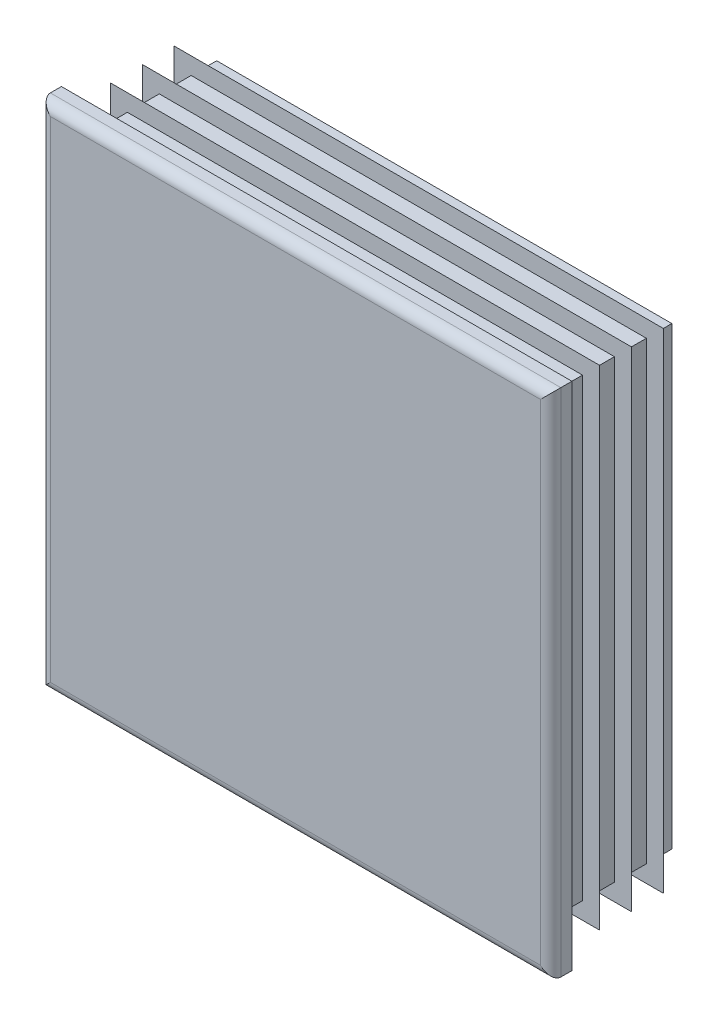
ISO-10303-21;
HEADER;
FILE_DESCRIPTION(('STEP AP214'),'2;1');
FILE_NAME('part.step','',(''),(''),'','','');
FILE_SCHEMA(('AUTOMOTIVE_DESIGN { 1 0 10303 214 1 1 1 1 }'));
ENDSEC;
DATA;
#1=APPLICATION_CONTEXT('core data for automotive mechanical design processes');
#2=APPLICATION_PROTOCOL_DEFINITION('international standard','automotive_design',2000,#1);
#3=PRODUCT_CONTEXT('',#1,'mechanical');
#4=PRODUCT('Part','Part','',(#3));
#5=PRODUCT_RELATED_PRODUCT_CATEGORY('part','',(#4));
#6=PRODUCT_DEFINITION_FORMATION('','',#4);
#7=PRODUCT_DEFINITION_CONTEXT('part definition',#1,'design');
#8=PRODUCT_DEFINITION('design','',#6,#7);
#9=PRODUCT_DEFINITION_SHAPE('','',#8);
#10=(LENGTH_UNIT() NAMED_UNIT(*) SI_UNIT(.MILLI.,.METRE.));
#11=(NAMED_UNIT(*) PLANE_ANGLE_UNIT() SI_UNIT($,.RADIAN.));
#12=(NAMED_UNIT(*) SI_UNIT($,.STERADIAN.) SOLID_ANGLE_UNIT());
#13=UNCERTAINTY_MEASURE_WITH_UNIT(LENGTH_MEASURE(1.E-05),#10,'distance_accuracy_value','');
#14=(GEOMETRIC_REPRESENTATION_CONTEXT(3) GLOBAL_UNCERTAINTY_ASSIGNED_CONTEXT((#13)) GLOBAL_UNIT_ASSIGNED_CONTEXT((#10,
#11,#12)) REPRESENTATION_CONTEXT('',''));
#15=CARTESIAN_POINT('',(0.,0.,0.));
#16=DIRECTION('',(0.,0.,1.));
#17=DIRECTION('',(1.,0.,0.));
#18=AXIS2_PLACEMENT_3D('',#15,#16,#17);
#19=CARTESIAN_POINT('',(57.6,-60.,5.));
#20=DIRECTION('',(0.,0.,-1.));
#21=DIRECTION('',(0.,1.,0.));
#22=AXIS2_PLACEMENT_3D('',#19,#20,#21);
#23=PLANE('',#22);
#24=DIRECTION('',(0.,1.,0.));
#25=VECTOR('',#24,1.);
#26=CARTESIAN_POINT('',(-57.6,-60.,5.));
#27=LINE('',#26,#25);
#28=CARTESIAN_POINT('',(-57.6,-57.6,5.));
#29=VERTEX_POINT('',#28);
#30=CARTESIAN_POINT('',(-57.6,57.6,5.));
#31=VERTEX_POINT('',#30);
#32=EDGE_CURVE('E262',#29,#31,#27,.T.);
#33=ORIENTED_EDGE('',*,*,#32,.F.);
#34=DIRECTION('',(-1.,0.,0.));
#35=VECTOR('',#34,1.);
#36=CARTESIAN_POINT('',(60.,-57.6,5.));
#37=LINE('',#36,#35);
#38=CARTESIAN_POINT('',(57.6,-57.6,5.));
#39=VERTEX_POINT('',#38);
#40=EDGE_CURVE('E432',#39,#29,#37,.T.);
#41=ORIENTED_EDGE('',*,*,#40,.F.);
#42=DIRECTION('',(0.,1.,0.));
#43=VECTOR('',#42,1.);
#44=CARTESIAN_POINT('',(57.6,-60.,5.));
#45=LINE('',#44,#43);
#46=CARTESIAN_POINT('',(57.6,57.6,5.));
#47=VERTEX_POINT('',#46);
#48=EDGE_CURVE('E257',#39,#47,#45,.T.);
#49=ORIENTED_EDGE('',*,*,#48,.T.);
#50=DIRECTION('',(-1.,0.,0.));
#51=VECTOR('',#50,1.);
#52=CARTESIAN_POINT('',(60.,57.6,5.));
#53=LINE('',#52,#51);
#54=EDGE_CURVE('E534',#47,#31,#53,.T.);
#55=ORIENTED_EDGE('',*,*,#54,.T.);
#56=EDGE_LOOP('',(#33,#41,#49,#55));
#57=FACE_BOUND('',#56,.T.);
#58=ADVANCED_FACE('F14',(#57),#23,.F.);
#59=CARTESIAN_POINT('',(-57.6,-60.,2.6));
#60=DIRECTION('',(0.,1.,0.));
#61=DIRECTION('',(-1.,0.,0.));
#62=AXIS2_PLACEMENT_3D('',#59,#60,#61);
#63=CYLINDRICAL_SURFACE('',#62,2.4);
#64=DIRECTION('',(0.,1.,0.));
#65=VECTOR('',#64,1.);
#66=CARTESIAN_POINT('',(-60.,-60.,2.6));
#67=LINE('',#66,#65);
#68=CARTESIAN_POINT('',(-60.,-60.,2.6));
#69=VERTEX_POINT('',#68);
#70=CARTESIAN_POINT('',(-60.,60.,2.6));
#71=VERTEX_POINT('',#70);
#72=EDGE_CURVE('E354',#69,#71,#67,.T.);
#73=ORIENTED_EDGE('',*,*,#72,.F.);
#74=CARTESIAN_POINT('',(-57.6,-57.6,2.6));
#75=DIRECTION('',(-0.707106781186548,0.707106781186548,0.));
#76=DIRECTION('',(0.707106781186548,0.707106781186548,0.));
#77=AXIS2_PLACEMENT_3D('',#74,#75,#76);
#78=ELLIPSE('',#77,3.39411254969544,2.4);
#79=EDGE_CURVE('E59',#69,#29,#78,.T.);
#80=ORIENTED_EDGE('',*,*,#79,.T.);
#81=ORIENTED_EDGE('',*,*,#32,.T.);
#82=CARTESIAN_POINT('',(-57.6,57.6,2.6));
#83=DIRECTION('',(0.707106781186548,0.707106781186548,0.));
#84=DIRECTION('',(-0.707106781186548,0.707106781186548,0.));
#85=AXIS2_PLACEMENT_3D('',#82,#83,#84);
#86=ELLIPSE('',#85,3.39411254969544,2.4);
#87=EDGE_CURVE('E258',#31,#71,#86,.F.);
#88=ORIENTED_EDGE('',*,*,#87,.T.);
#89=EDGE_LOOP('',(#73,#80,#81,#88));
#90=FACE_BOUND('',#89,.T.);
#91=ADVANCED_FACE('F16',(#90),#63,.T.);
#92=CARTESIAN_POINT('',(-60.,-60.,2.6));
#93=DIRECTION('',(1.,0.,0.));
#94=DIRECTION('',(0.,1.,0.));
#95=AXIS2_PLACEMENT_3D('',#92,#93,#94);
#96=PLANE('',#95);
#97=DIRECTION('',(0.,0.,-1.));
#98=VECTOR('',#97,1.);
#99=CARTESIAN_POINT('',(-60.,60.,2.6));
#100=LINE('',#99,#98);
#101=CARTESIAN_POINT('',(-60.,60.,0.));
#102=VERTEX_POINT('',#101);
#103=EDGE_CURVE('E519',#71,#102,#100,.T.);
#104=ORIENTED_EDGE('',*,*,#103,.T.);
#105=DIRECTION('',(0.,1.,0.));
#106=VECTOR('',#105,1.);
#107=CARTESIAN_POINT('',(-60.,-60.,0.));
#108=LINE('',#107,#106);
#109=CARTESIAN_POINT('',(-60.,-60.,0.));
#110=VERTEX_POINT('',#109);
#111=EDGE_CURVE('E352',#110,#102,#108,.T.);
#112=ORIENTED_EDGE('',*,*,#111,.F.);
#113=DIRECTION('',(0.,0.,-1.));
#114=VECTOR('',#113,1.);
#115=CARTESIAN_POINT('',(-60.,-60.,2.6));
#116=LINE('',#115,#114);
#117=EDGE_CURVE('E520',#69,#110,#116,.T.);
#118=ORIENTED_EDGE('',*,*,#117,.F.);
#119=ORIENTED_EDGE('',*,*,#72,.T.);
#120=EDGE_LOOP('',(#104,#112,#118,#119));
#121=FACE_BOUND('',#120,.T.);
#122=ADVANCED_FACE('F604',(#121),#96,.F.);
#123=CARTESIAN_POINT('',(-53.5,-60.,0.));
#124=DIRECTION('',(1.,0.,0.));
#125=DIRECTION('',(0.,1.,0.));
#126=AXIS2_PLACEMENT_3D('',#123,#124,#125);
#127=PLANE('',#126);
#128=DIRECTION('',(0.,1.,0.));
#129=VECTOR('',#128,1.);
#130=CARTESIAN_POINT('',(-53.5,-60.,0.));
#131=LINE('',#130,#129);
#132=CARTESIAN_POINT('',(-53.5,-53.5,0.));
#133=VERTEX_POINT('',#132);
#134=CARTESIAN_POINT('',(-53.5,53.5,0.));
#135=VERTEX_POINT('',#134);
#136=EDGE_CURVE('E349',#133,#135,#131,.T.);
#137=ORIENTED_EDGE('',*,*,#136,.T.);
#138=DIRECTION('',(0.,0.,-1.));
#139=VECTOR('',#138,1.);
#140=CARTESIAN_POINT('',(-53.5,53.5,0.));
#141=LINE('',#140,#139);
#142=CARTESIAN_POINT('',(-53.5,53.5,-1.5));
#143=VERTEX_POINT('',#142);
#144=EDGE_CURVE('E445',#135,#143,#141,.T.);
#145=ORIENTED_EDGE('',*,*,#144,.T.);
#146=DIRECTION('',(0.,1.,0.));
#147=VECTOR('',#146,1.);
#148=CARTESIAN_POINT('',(-53.5,-60.,-1.5));
#149=LINE('',#148,#147);
#150=CARTESIAN_POINT('',(-53.5,-53.5,-1.5));
#151=VERTEX_POINT('',#150);
#152=EDGE_CURVE('E346',#151,#143,#149,.T.);
#153=ORIENTED_EDGE('',*,*,#152,.F.);
#154=DIRECTION('',(0.,0.,1.));
#155=VECTOR('',#154,1.);
#156=CARTESIAN_POINT('',(-53.5,-53.5,0.));
#157=LINE('',#156,#155);
#158=EDGE_CURVE('E439',#151,#133,#157,.T.);
#159=ORIENTED_EDGE('',*,*,#158,.T.);
#160=EDGE_LOOP('',(#137,#145,#153,#159));
#161=FACE_BOUND('',#160,.T.);
#162=ADVANCED_FACE('F728',(#161),#127,.F.);
#163=CARTESIAN_POINT('',(-57.5,-60.,-1.5));
#164=DIRECTION('',(0.573576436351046,0.,0.819152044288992));
#165=DIRECTION('',(-0.819152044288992,0.,0.573576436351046));
#166=AXIS2_PLACEMENT_3D('',#163,#164,#165);
#167=PLANE('',#166);
#168=DIRECTION('',(0.,1.,0.));
#169=VECTOR('',#168,1.);
#170=CARTESIAN_POINT('',(-57.5,-60.,-1.5));
#171=LINE('',#170,#169);
#172=CARTESIAN_POINT('',(-57.5,-57.5,-1.5));
#173=VERTEX_POINT('',#172);
#174=CARTESIAN_POINT('',(-57.5,57.5,-1.5));
#175=VERTEX_POINT('',#174);
#176=EDGE_CURVE('E344',#173,#175,#171,.T.);
#177=ORIENTED_EDGE('',*,*,#176,.T.);
#178=DIRECTION('',(0.633687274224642,-0.633687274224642,-0.443712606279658));
#179=VECTOR('',#178,1.);
#180=CARTESIAN_POINT('',(-10.3167515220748,10.3167515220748,-34.538066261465));
#181=LINE('',#180,#179);
#182=CARTESIAN_POINT('',(-53.5,53.5,-4.30083015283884));
#183=VERTEX_POINT('',#182);
#184=EDGE_CURVE('E457',#175,#183,#181,.T.);
#185=ORIENTED_EDGE('',*,*,#184,.T.);
#186=DIRECTION('',(0.,1.,0.));
#187=VECTOR('',#186,1.);
#188=CARTESIAN_POINT('',(-53.5,-60.,-4.30083015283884));
#189=LINE('',#188,#187);
#190=CARTESIAN_POINT('',(-53.5,-53.5,-4.30083015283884));
#191=VERTEX_POINT('',#190);
#192=EDGE_CURVE('E341',#191,#183,#189,.T.);
#193=ORIENTED_EDGE('',*,*,#192,.F.);
#194=DIRECTION('',(-0.633687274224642,-0.633687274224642,0.443712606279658));
#195=VECTOR('',#194,1.);
#196=CARTESIAN_POINT('',(-58.5038989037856,-58.5038989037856,-0.797062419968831));
#197=LINE('',#196,#195);
#198=EDGE_CURVE('E451',#191,#173,#197,.T.);
#199=ORIENTED_EDGE('',*,*,#198,.T.);
#200=EDGE_LOOP('',(#177,#185,#193,#199));
#201=FACE_BOUND('',#200,.T.);
#202=ADVANCED_FACE('F732',(#201),#167,.F.);
#203=CARTESIAN_POINT('',(-53.5,-60.,-4.30083015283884));
#204=DIRECTION('',(1.,0.,0.));
#205=DIRECTION('',(0.,1.,0.));
#206=AXIS2_PLACEMENT_3D('',#203,#204,#205);
#207=PLANE('',#206);
#208=ORIENTED_EDGE('',*,*,#192,.T.);
#209=DIRECTION('',(0.,0.,-1.));
#210=VECTOR('',#209,1.);
#211=CARTESIAN_POINT('',(-53.5,53.5,-4.30083015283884));
#212=LINE('',#211,#210);
#213=CARTESIAN_POINT('',(-53.5,53.5,-9.));
#214=VERTEX_POINT('',#213);
#215=EDGE_CURVE('E463',#183,#214,#212,.T.);
#216=ORIENTED_EDGE('',*,*,#215,.T.);
#217=DIRECTION('',(0.,1.,0.));
#218=VECTOR('',#217,1.);
#219=CARTESIAN_POINT('',(-53.5,-60.,-9.));
#220=LINE('',#219,#218);
#221=CARTESIAN_POINT('',(-53.5,-53.5,-9.));
#222=VERTEX_POINT('',#221);
#223=EDGE_CURVE('E338',#222,#214,#220,.T.);
#224=ORIENTED_EDGE('',*,*,#223,.F.);
#225=DIRECTION('',(0.,0.,1.));
#226=VECTOR('',#225,1.);
#227=CARTESIAN_POINT('',(-53.5,-53.5,-4.30083015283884));
#228=LINE('',#227,#226);
#229=EDGE_CURVE('E460',#222,#191,#228,.T.);
#230=ORIENTED_EDGE('',*,*,#229,.T.);
#231=EDGE_LOOP('',(#208,#216,#224,#230));
#232=FACE_BOUND('',#231,.T.);
#233=ADVANCED_FACE('F738',(#232),#207,.F.);
#234=CARTESIAN_POINT('',(-57.5,-60.,-9.));
#235=DIRECTION('',(0.573576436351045,0.,0.819152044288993));
#236=DIRECTION('',(-0.819152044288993,0.,0.573576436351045));
#237=AXIS2_PLACEMENT_3D('',#234,#235,#236);
#238=PLANE('',#237);
#239=DIRECTION('',(0.,1.,0.));
#240=VECTOR('',#239,1.);
#241=CARTESIAN_POINT('',(-57.5,-60.,-9.));
#242=LINE('',#241,#240);
#243=CARTESIAN_POINT('',(-57.5,-57.5,-9.));
#244=VERTEX_POINT('',#243);
#245=CARTESIAN_POINT('',(-57.5,57.5,-9.));
#246=VERTEX_POINT('',#245);
#247=EDGE_CURVE('E336',#244,#246,#242,.T.);
#248=ORIENTED_EDGE('',*,*,#247,.T.);
#249=DIRECTION('',(0.633687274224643,-0.633687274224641,-0.443712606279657));
#250=VECTOR('',#249,1.);
#251=CARTESIAN_POINT('',(-10.3167515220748,10.3167515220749,-42.0380662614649));
#252=LINE('',#251,#250);
#253=CARTESIAN_POINT('',(-53.5,53.5,-11.8008301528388));
#254=VERTEX_POINT('',#253);
#255=EDGE_CURVE('E475',#246,#254,#252,.T.);
#256=ORIENTED_EDGE('',*,*,#255,.T.);
#257=DIRECTION('',(0.,1.,0.));
#258=VECTOR('',#257,1.);
#259=CARTESIAN_POINT('',(-53.5,-60.,-11.8008301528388));
#260=LINE('',#259,#258);
#261=CARTESIAN_POINT('',(-53.5,-53.5,-11.8008301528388));
#262=VERTEX_POINT('',#261);
#263=EDGE_CURVE('E333',#262,#254,#260,.T.);
#264=ORIENTED_EDGE('',*,*,#263,.F.);
#265=DIRECTION('',(-0.633687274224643,-0.633687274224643,0.443712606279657));
#266=VECTOR('',#265,1.);
#267=CARTESIAN_POINT('',(-58.5038989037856,-58.5038989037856,-8.29706241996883));
#268=LINE('',#267,#266);
#269=EDGE_CURVE('E469',#262,#244,#268,.T.);
#270=ORIENTED_EDGE('',*,*,#269,.T.);
#271=EDGE_LOOP('',(#248,#256,#264,#270));
#272=FACE_BOUND('',#271,.T.);
#273=ADVANCED_FACE('F742',(#272),#238,.F.);
#274=CARTESIAN_POINT('',(-53.5,-60.,-11.8008301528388));
#275=DIRECTION('',(1.,0.,0.));
#276=DIRECTION('',(0.,1.,0.));
#277=AXIS2_PLACEMENT_3D('',#274,#275,#276);
#278=PLANE('',#277);
#279=ORIENTED_EDGE('',*,*,#263,.T.);
#280=DIRECTION('',(0.,0.,-1.));
#281=VECTOR('',#280,1.);
#282=CARTESIAN_POINT('',(-53.5,53.5,-11.8008301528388));
#283=LINE('',#282,#281);
#284=CARTESIAN_POINT('',(-53.5,53.5,-16.5));
#285=VERTEX_POINT('',#284);
#286=EDGE_CURVE('E481',#254,#285,#283,.T.);
#287=ORIENTED_EDGE('',*,*,#286,.T.);
#288=DIRECTION('',(0.,1.,0.));
#289=VECTOR('',#288,1.);
#290=CARTESIAN_POINT('',(-53.5,-60.,-16.5));
#291=LINE('',#290,#289);
#292=CARTESIAN_POINT('',(-53.5,-53.5,-16.5));
#293=VERTEX_POINT('',#292);
#294=EDGE_CURVE('E330',#293,#285,#291,.T.);
#295=ORIENTED_EDGE('',*,*,#294,.F.);
#296=DIRECTION('',(0.,0.,1.));
#297=VECTOR('',#296,1.);
#298=CARTESIAN_POINT('',(-53.5,-53.5,-11.8008301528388));
#299=LINE('',#298,#297);
#300=EDGE_CURVE('E478',#293,#262,#299,.T.);
#301=ORIENTED_EDGE('',*,*,#300,.T.);
#302=EDGE_LOOP('',(#279,#287,#295,#301));
#303=FACE_BOUND('',#302,.T.);
#304=ADVANCED_FACE('F746',(#303),#278,.F.);
#305=CARTESIAN_POINT('',(-57.5,-60.,-16.5));
#306=DIRECTION('',(0.573576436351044,0.,0.819152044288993));
#307=DIRECTION('',(-0.819152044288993,0.,0.573576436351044));
#308=AXIS2_PLACEMENT_3D('',#305,#306,#307);
#309=PLANE('',#308);
#310=DIRECTION('',(0.,1.,0.));
#311=VECTOR('',#310,1.);
#312=CARTESIAN_POINT('',(-57.5,-60.,-16.5));
#313=LINE('',#312,#311);
#314=CARTESIAN_POINT('',(-57.5,-57.5,-16.5));
#315=VERTEX_POINT('',#314);
#316=CARTESIAN_POINT('',(-57.5,57.5,-16.5));
#317=VERTEX_POINT('',#316);
#318=EDGE_CURVE('E328',#315,#317,#313,.T.);
#319=ORIENTED_EDGE('',*,*,#318,.T.);
#320=DIRECTION('',(0.633687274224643,-0.633687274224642,-0.443712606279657));
#321=VECTOR('',#320,1.);
#322=CARTESIAN_POINT('',(-10.3167515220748,10.3167515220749,-49.5380662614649));
#323=LINE('',#322,#321);
#324=CARTESIAN_POINT('',(-53.5,53.5,-19.3008301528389));
#325=VERTEX_POINT('',#324);
#326=EDGE_CURVE('E493',#317,#325,#323,.T.);
#327=ORIENTED_EDGE('',*,*,#326,.T.);
#328=DIRECTION('',(0.,1.,0.));
#329=VECTOR('',#328,1.);
#330=CARTESIAN_POINT('',(-53.5,-60.,-19.3008301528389));
#331=LINE('',#330,#329);
#332=CARTESIAN_POINT('',(-53.5,-53.5,-19.3008301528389));
#333=VERTEX_POINT('',#332);
#334=EDGE_CURVE('E325',#333,#325,#331,.T.);
#335=ORIENTED_EDGE('',*,*,#334,.F.);
#336=DIRECTION('',(-0.633687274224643,-0.633687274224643,0.443712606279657));
#337=VECTOR('',#336,1.);
#338=CARTESIAN_POINT('',(-58.5038989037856,-58.5038989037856,-15.7970624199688));
#339=LINE('',#338,#337);
#340=EDGE_CURVE('E487',#333,#315,#339,.T.);
#341=ORIENTED_EDGE('',*,*,#340,.T.);
#342=EDGE_LOOP('',(#319,#327,#335,#341));
#343=FACE_BOUND('',#342,.T.);
#344=ADVANCED_FACE('F668',(#343),#309,.F.);
#345=CARTESIAN_POINT('',(-53.5,-60.,-19.3008301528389));
#346=DIRECTION('',(1.,0.,0.));
#347=DIRECTION('',(0.,1.,0.));
#348=AXIS2_PLACEMENT_3D('',#345,#346,#347);
#349=PLANE('',#348);
#350=ORIENTED_EDGE('',*,*,#334,.T.);
#351=DIRECTION('',(0.,0.,-1.));
#352=VECTOR('',#351,1.);
#353=CARTESIAN_POINT('',(-53.5,53.5,-19.3008301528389));
#354=LINE('',#353,#352);
#355=CARTESIAN_POINT('',(-53.5,53.5,-24.));
#356=VERTEX_POINT('',#355);
#357=EDGE_CURVE('E499',#325,#356,#354,.T.);
#358=ORIENTED_EDGE('',*,*,#357,.T.);
#359=DIRECTION('',(0.,1.,0.));
#360=VECTOR('',#359,1.);
#361=CARTESIAN_POINT('',(-53.5,-60.,-24.));
#362=LINE('',#361,#360);
#363=CARTESIAN_POINT('',(-53.5,-53.5,-24.));
#364=VERTEX_POINT('',#363);
#365=EDGE_CURVE('E322',#364,#356,#362,.T.);
#366=ORIENTED_EDGE('',*,*,#365,.F.);
#367=DIRECTION('',(0.,0.,1.));
#368=VECTOR('',#367,1.);
#369=CARTESIAN_POINT('',(-53.5,-53.5,-19.3008301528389));
#370=LINE('',#369,#368);
#371=EDGE_CURVE('E496',#364,#333,#370,.T.);
#372=ORIENTED_EDGE('',*,*,#371,.T.);
#373=EDGE_LOOP('',(#350,#358,#366,#372));
#374=FACE_BOUND('',#373,.T.);
#375=ADVANCED_FACE('F665',(#374),#349,.F.);
#376=CARTESIAN_POINT('',(-57.5,-60.,-24.));
#377=DIRECTION('',(0.573576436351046,0.,0.819152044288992));
#378=DIRECTION('',(-0.819152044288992,0.,0.573576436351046));
#379=AXIS2_PLACEMENT_3D('',#376,#377,#378);
#380=PLANE('',#379);
#381=DIRECTION('',(0.,1.,0.));
#382=VECTOR('',#381,1.);
#383=CARTESIAN_POINT('',(-57.5,-60.,-24.));
#384=LINE('',#383,#382);
#385=CARTESIAN_POINT('',(-57.5,-57.5,-24.));
#386=VERTEX_POINT('',#385);
#387=CARTESIAN_POINT('',(-57.5,57.5,-24.));
#388=VERTEX_POINT('',#387);
#389=EDGE_CURVE('E320',#386,#388,#384,.T.);
#390=ORIENTED_EDGE('',*,*,#389,.T.);
#391=DIRECTION('',(0.633687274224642,-0.633687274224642,-0.443712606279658));
#392=VECTOR('',#391,1.);
#393=CARTESIAN_POINT('',(-10.3167515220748,10.3167515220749,-57.038066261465));
#394=LINE('',#393,#392);
#395=CARTESIAN_POINT('',(-53.5,53.5,-26.8008301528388));
#396=VERTEX_POINT('',#395);
#397=EDGE_CURVE('E511',#388,#396,#394,.T.);
#398=ORIENTED_EDGE('',*,*,#397,.T.);
#399=DIRECTION('',(0.,1.,0.));
#400=VECTOR('',#399,1.);
#401=CARTESIAN_POINT('',(-53.5,-60.,-26.8008301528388));
#402=LINE('',#401,#400);
#403=CARTESIAN_POINT('',(-53.5,-53.5,-26.8008301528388));
#404=VERTEX_POINT('',#403);
#405=EDGE_CURVE('E317',#404,#396,#402,.T.);
#406=ORIENTED_EDGE('',*,*,#405,.F.);
#407=DIRECTION('',(-0.633687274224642,-0.633687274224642,0.443712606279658));
#408=VECTOR('',#407,1.);
#409=CARTESIAN_POINT('',(-58.5038989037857,-58.5038989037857,-23.2970624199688));
#410=LINE('',#409,#408);
#411=EDGE_CURVE('E505',#404,#386,#410,.T.);
#412=ORIENTED_EDGE('',*,*,#411,.T.);
#413=EDGE_LOOP('',(#390,#398,#406,#412));
#414=FACE_BOUND('',#413,.T.);
#415=ADVANCED_FACE('F580',(#414),#380,.F.);
#416=CARTESIAN_POINT('',(-53.5,-60.,-26.8008301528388));
#417=DIRECTION('',(1.,0.,0.));
#418=DIRECTION('',(0.,1.,0.));
#419=AXIS2_PLACEMENT_3D('',#416,#417,#418);
#420=PLANE('',#419);
#421=ORIENTED_EDGE('',*,*,#405,.T.);
#422=DIRECTION('',(0.,0.,-1.));
#423=VECTOR('',#422,1.);
#424=CARTESIAN_POINT('',(-53.5,53.5,-26.8008301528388));
#425=LINE('',#424,#423);
#426=CARTESIAN_POINT('',(-53.5,53.5,-30.));
#427=VERTEX_POINT('',#426);
#428=EDGE_CURVE('E517',#396,#427,#425,.T.);
#429=ORIENTED_EDGE('',*,*,#428,.T.);
#430=DIRECTION('',(0.,1.,0.));
#431=VECTOR('',#430,1.);
#432=CARTESIAN_POINT('',(-53.5,-60.,-30.));
#433=LINE('',#432,#431);
#434=CARTESIAN_POINT('',(-53.5,-53.5,-30.));
#435=VERTEX_POINT('',#434);
#436=EDGE_CURVE('E314',#435,#427,#433,.T.);
#437=ORIENTED_EDGE('',*,*,#436,.F.);
#438=DIRECTION('',(0.,0.,1.));
#439=VECTOR('',#438,1.);
#440=CARTESIAN_POINT('',(-53.5,-53.5,-26.8008301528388));
#441=LINE('',#440,#439);
#442=EDGE_CURVE('E514',#435,#404,#441,.T.);
#443=ORIENTED_EDGE('',*,*,#442,.T.);
#444=EDGE_LOOP('',(#421,#429,#437,#443));
#445=FACE_BOUND('',#444,.T.);
#446=ADVANCED_FACE('F582',(#445),#420,.F.);
#447=CARTESIAN_POINT('',(-53.5,-60.,-30.));
#448=DIRECTION('',(0.,0.,1.));
#449=DIRECTION('',(0.,-1.,0.));
#450=AXIS2_PLACEMENT_3D('',#447,#448,#449);
#451=PLANE('',#450);
#452=ORIENTED_EDGE('',*,*,#436,.T.);
#453=DIRECTION('',(-1.,0.,0.));
#454=VECTOR('',#453,1.);
#455=CARTESIAN_POINT('',(60.,53.5,-30.));
#456=LINE('',#455,#454);
#457=CARTESIAN_POINT('',(53.5,53.5,-30.));
#458=VERTEX_POINT('',#457);
#459=EDGE_CURVE('E388',#458,#427,#456,.T.);
#460=ORIENTED_EDGE('',*,*,#459,.F.);
#461=DIRECTION('',(0.,1.,0.));
#462=VECTOR('',#461,1.);
#463=CARTESIAN_POINT('',(53.5,-60.,-30.));
#464=LINE('',#463,#462);
#465=CARTESIAN_POINT('',(53.5,-53.5,-30.));
#466=VERTEX_POINT('',#465);
#467=EDGE_CURVE('E311',#466,#458,#464,.T.);
#468=ORIENTED_EDGE('',*,*,#467,.F.);
#469=DIRECTION('',(-1.,0.,0.));
#470=VECTOR('',#469,1.);
#471=CARTESIAN_POINT('',(60.,-53.5,-30.));
#472=LINE('',#471,#470);
#473=EDGE_CURVE('E386',#466,#435,#472,.T.);
#474=ORIENTED_EDGE('',*,*,#473,.T.);
#475=EDGE_LOOP('',(#452,#460,#468,#474));
#476=FACE_BOUND('',#475,.T.);
#477=ADVANCED_FACE('F385',(#476),#451,.F.);
#478=CARTESIAN_POINT('',(53.5,-60.,-30.));
#479=DIRECTION('',(-1.,0.,0.));
#480=DIRECTION('',(0.,-1.,0.));
#481=AXIS2_PLACEMENT_3D('',#478,#479,#480);
#482=PLANE('',#481);
#483=ORIENTED_EDGE('',*,*,#467,.T.);
#484=DIRECTION('',(0.,0.,1.));
#485=VECTOR('',#484,1.);
#486=CARTESIAN_POINT('',(53.5,53.5,-30.));
#487=LINE('',#486,#485);
#488=CARTESIAN_POINT('',(53.5,53.5,-26.8008301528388));
#489=VERTEX_POINT('',#488);
#490=EDGE_CURVE('E9',#458,#489,#487,.T.);
#491=ORIENTED_EDGE('',*,*,#490,.T.);
#492=DIRECTION('',(0.,1.,0.));
#493=VECTOR('',#492,1.);
#494=CARTESIAN_POINT('',(53.5,-60.,-26.8008301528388));
#495=LINE('',#494,#493);
#496=CARTESIAN_POINT('',(53.5,-53.5,-26.8008301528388));
#497=VERTEX_POINT('',#496);
#498=EDGE_CURVE('E308',#497,#489,#495,.T.);
#499=ORIENTED_EDGE('',*,*,#498,.F.);
#500=DIRECTION('',(0.,0.,-1.));
#501=VECTOR('',#500,1.);
#502=CARTESIAN_POINT('',(53.5,-53.5,-30.));
#503=LINE('',#502,#501);
#504=EDGE_CURVE('E23',#497,#466,#503,.T.);
#505=ORIENTED_EDGE('',*,*,#504,.T.);
#506=EDGE_LOOP('',(#483,#491,#499,#505));
#507=FACE_BOUND('',#506,.T.);
#508=ADVANCED_FACE('F378',(#507),#482,.F.);
#509=CARTESIAN_POINT('',(53.5,-60.,-26.8008301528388));
#510=DIRECTION('',(-0.573576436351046,0.,0.819152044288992));
#511=DIRECTION('',(-0.819152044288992,0.,-0.573576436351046));
#512=AXIS2_PLACEMENT_3D('',#509,#510,#511);
#513=PLANE('',#512);
#514=ORIENTED_EDGE('',*,*,#498,.T.);
#515=DIRECTION('',(0.633687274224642,0.633687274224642,0.443712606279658));
#516=VECTOR('',#515,1.);
#517=CARTESIAN_POINT('',(7.92298976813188,7.92298976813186,-58.714196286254));
#518=LINE('',#517,#516);
#519=CARTESIAN_POINT('',(57.5,57.5,-24.));
#520=VERTEX_POINT('',#519);
#521=EDGE_CURVE('E508',#489,#520,#518,.T.);
#522=ORIENTED_EDGE('',*,*,#521,.T.);
#523=DIRECTION('',(0.,1.,0.));
#524=VECTOR('',#523,1.);
#525=CARTESIAN_POINT('',(57.5,-60.,-24.));
#526=LINE('',#525,#524);
#527=CARTESIAN_POINT('',(57.5,-57.5,-24.));
#528=VERTEX_POINT('',#527);
#529=EDGE_CURVE('E305',#528,#520,#526,.T.);
#530=ORIENTED_EDGE('',*,*,#529,.F.);
#531=DIRECTION('',(-0.633687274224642,0.633687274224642,-0.443712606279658));
#532=VECTOR('',#531,1.);
#533=CARTESIAN_POINT('',(56.1101371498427,-56.1101371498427,-24.9731924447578));
#534=LINE('',#533,#532);
#535=EDGE_CURVE('E502',#528,#497,#534,.T.);
#536=ORIENTED_EDGE('',*,*,#535,.T.);
#537=EDGE_LOOP('',(#514,#522,#530,#536));
#538=FACE_BOUND('',#537,.T.);
#539=ADVANCED_FACE('F588',(#538),#513,.F.);
#540=CARTESIAN_POINT('',(57.5,-60.,-24.));
#541=DIRECTION('',(0.,0.,-1.));
#542=DIRECTION('',(0.,1.,0.));
#543=AXIS2_PLACEMENT_3D('',#540,#541,#542);
#544=PLANE('',#543);
#545=ORIENTED_EDGE('',*,*,#529,.T.);
#546=DIRECTION('',(-1.,0.,0.));
#547=VECTOR('',#546,1.);
#548=CARTESIAN_POINT('',(60.,57.5,-24.));
#549=LINE('',#548,#547);
#550=EDGE_CURVE('E394',#520,#388,#549,.T.);
#551=ORIENTED_EDGE('',*,*,#550,.T.);
#552=ORIENTED_EDGE('',*,*,#389,.F.);
#553=DIRECTION('',(-1.,0.,0.));
#554=VECTOR('',#553,1.);
#555=CARTESIAN_POINT('',(60.,-57.5,-24.));
#556=LINE('',#555,#554);
#557=EDGE_CURVE('E401',#528,#386,#556,.T.);
#558=ORIENTED_EDGE('',*,*,#557,.F.);
#559=EDGE_LOOP('',(#545,#551,#552,#558));
#560=FACE_BOUND('',#559,.T.);
#561=ORIENTED_EDGE('',*,*,#365,.T.);
#562=DIRECTION('',(-1.,0.,0.));
#563=VECTOR('',#562,1.);
#564=CARTESIAN_POINT('',(60.,53.5,-24.));
#565=LINE('',#564,#563);
#566=CARTESIAN_POINT('',(53.5,53.5,-24.));
#567=VERTEX_POINT('',#566);
#568=EDGE_CURVE('E567',#567,#356,#565,.T.);
#569=ORIENTED_EDGE('',*,*,#568,.F.);
#570=DIRECTION('',(0.,1.,0.));
#571=VECTOR('',#570,1.);
#572=CARTESIAN_POINT('',(53.5,-60.,-24.));
#573=LINE('',#572,#571);
#574=CARTESIAN_POINT('',(53.5,-53.5,-24.));
#575=VERTEX_POINT('',#574);
#576=EDGE_CURVE('E302',#575,#567,#573,.T.);
#577=ORIENTED_EDGE('',*,*,#576,.F.);
#578=DIRECTION('',(-1.,0.,0.));
#579=VECTOR('',#578,1.);
#580=CARTESIAN_POINT('',(60.,-53.5,-24.));
#581=LINE('',#580,#579);
#582=EDGE_CURVE('E403',#575,#364,#581,.T.);
#583=ORIENTED_EDGE('',*,*,#582,.T.);
#584=EDGE_LOOP('',(#561,#569,#577,#583));
#585=FACE_BOUND('',#584,.T.);
#586=ADVANCED_FACE('F571',(#560,#585),#544,.F.);
#587=CARTESIAN_POINT('',(53.5,-60.,-24.));
#588=DIRECTION('',(-1.,0.,0.));
#589=DIRECTION('',(0.,-1.,0.));
#590=AXIS2_PLACEMENT_3D('',#587,#588,#589);
#591=PLANE('',#590);
#592=ORIENTED_EDGE('',*,*,#576,.T.);
#593=DIRECTION('',(0.,0.,1.));
#594=VECTOR('',#593,1.);
#595=CARTESIAN_POINT('',(53.5,53.5,-24.));
#596=LINE('',#595,#594);
#597=CARTESIAN_POINT('',(53.5,53.5,-19.3008301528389));
#598=VERTEX_POINT('',#597);
#599=EDGE_CURVE('E372',#567,#598,#596,.T.);
#600=ORIENTED_EDGE('',*,*,#599,.T.);
#601=DIRECTION('',(0.,1.,0.));
#602=VECTOR('',#601,1.);
#603=CARTESIAN_POINT('',(53.5,-60.,-19.3008301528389));
#604=LINE('',#603,#602);
#605=CARTESIAN_POINT('',(53.5,-53.5,-19.3008301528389));
#606=VERTEX_POINT('',#605);
#607=EDGE_CURVE('E299',#606,#598,#604,.T.);
#608=ORIENTED_EDGE('',*,*,#607,.F.);
#609=DIRECTION('',(0.,0.,-1.));
#610=VECTOR('',#609,1.);
#611=CARTESIAN_POINT('',(53.5,-53.5,-24.));
#612=LINE('',#611,#610);
#613=EDGE_CURVE('E369',#606,#575,#612,.T.);
#614=ORIENTED_EDGE('',*,*,#613,.T.);
#615=EDGE_LOOP('',(#592,#600,#608,#614));
#616=FACE_BOUND('',#615,.T.);
#617=ADVANCED_FACE('F596',(#616),#591,.F.);
#618=CARTESIAN_POINT('',(53.5,-60.,-19.3008301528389));
#619=DIRECTION('',(-0.573576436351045,0.,0.819152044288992));
#620=DIRECTION('',(-0.819152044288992,0.,-0.573576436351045));
#621=AXIS2_PLACEMENT_3D('',#618,#619,#620);
#622=PLANE('',#621);
#623=ORIENTED_EDGE('',*,*,#607,.T.);
#624=DIRECTION('',(0.633687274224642,0.633687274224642,0.443712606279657));
#625=VECTOR('',#624,1.);
#626=CARTESIAN_POINT('',(7.92298976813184,7.92298976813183,-51.2141962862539));
#627=LINE('',#626,#625);
#628=CARTESIAN_POINT('',(57.5,57.5,-16.5));
#629=VERTEX_POINT('',#628);
#630=EDGE_CURVE('E490',#598,#629,#627,.T.);
#631=ORIENTED_EDGE('',*,*,#630,.T.);
#632=DIRECTION('',(0.,1.,0.));
#633=VECTOR('',#632,1.);
#634=CARTESIAN_POINT('',(57.5,-60.,-16.5));
#635=LINE('',#634,#633);
#636=CARTESIAN_POINT('',(57.5,-57.5,-16.5));
#637=VERTEX_POINT('',#636);
#638=EDGE_CURVE('E296',#637,#629,#635,.T.);
#639=ORIENTED_EDGE('',*,*,#638,.F.);
#640=DIRECTION('',(-0.633687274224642,0.633687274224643,-0.443712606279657));
#641=VECTOR('',#640,1.);
#642=CARTESIAN_POINT('',(56.1101371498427,-56.1101371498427,-17.4731924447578));
#643=LINE('',#642,#641);
#644=EDGE_CURVE('E484',#637,#606,#643,.T.);
#645=ORIENTED_EDGE('',*,*,#644,.T.);
#646=EDGE_LOOP('',(#623,#631,#639,#645));
#647=FACE_BOUND('',#646,.T.);
#648=ADVANCED_FACE('F648',(#647),#622,.F.);
#649=CARTESIAN_POINT('',(57.5,-60.,-16.5));
#650=DIRECTION('',(0.,0.,-1.));
#651=DIRECTION('',(0.,1.,0.));
#652=AXIS2_PLACEMENT_3D('',#649,#650,#651);
#653=PLANE('',#652);
#654=ORIENTED_EDGE('',*,*,#638,.T.);
#655=DIRECTION('',(-1.,0.,0.));
#656=VECTOR('',#655,1.);
#657=CARTESIAN_POINT('',(60.,57.5,-16.5));
#658=LINE('',#657,#656);
#659=EDGE_CURVE('E561',#629,#317,#658,.T.);
#660=ORIENTED_EDGE('',*,*,#659,.T.);
#661=ORIENTED_EDGE('',*,*,#318,.F.);
#662=DIRECTION('',(-1.,0.,0.));
#663=VECTOR('',#662,1.);
#664=CARTESIAN_POINT('',(60.,-57.5,-16.5));
#665=LINE('',#664,#663);
#666=EDGE_CURVE('E409',#637,#315,#665,.T.);
#667=ORIENTED_EDGE('',*,*,#666,.F.);
#668=EDGE_LOOP('',(#654,#660,#661,#667));
#669=FACE_BOUND('',#668,.T.);
#670=ORIENTED_EDGE('',*,*,#294,.T.);
#671=DIRECTION('',(-1.,0.,0.));
#672=VECTOR('',#671,1.);
#673=CARTESIAN_POINT('',(60.,53.5,-16.5));
#674=LINE('',#673,#672);
#675=CARTESIAN_POINT('',(53.5,53.5,-16.5));
#676=VERTEX_POINT('',#675);
#677=EDGE_CURVE('E559',#676,#285,#674,.T.);
#678=ORIENTED_EDGE('',*,*,#677,.F.);
#679=DIRECTION('',(0.,1.,0.));
#680=VECTOR('',#679,1.);
#681=CARTESIAN_POINT('',(53.5,-60.,-16.5));
#682=LINE('',#681,#680);
#683=CARTESIAN_POINT('',(53.5,-53.5,-16.5));
#684=VERTEX_POINT('',#683);
#685=EDGE_CURVE('E293',#684,#676,#682,.T.);
#686=ORIENTED_EDGE('',*,*,#685,.F.);
#687=DIRECTION('',(-1.,0.,0.));
#688=VECTOR('',#687,1.);
#689=CARTESIAN_POINT('',(60.,-53.5,-16.5));
#690=LINE('',#689,#688);
#691=EDGE_CURVE('E411',#684,#293,#690,.T.);
#692=ORIENTED_EDGE('',*,*,#691,.T.);
#693=EDGE_LOOP('',(#670,#678,#686,#692));
#694=FACE_BOUND('',#693,.T.);
#695=ADVANCED_FACE('F644',(#669,#694),#653,.F.);
#696=CARTESIAN_POINT('',(53.5,-60.,-16.5));
#697=DIRECTION('',(-1.,0.,0.));
#698=DIRECTION('',(0.,-1.,0.));
#699=AXIS2_PLACEMENT_3D('',#696,#697,#698);
#700=PLANE('',#699);
#701=ORIENTED_EDGE('',*,*,#685,.T.);
#702=DIRECTION('',(0.,0.,1.));
#703=VECTOR('',#702,1.);
#704=CARTESIAN_POINT('',(53.5,53.5,-16.5));
#705=LINE('',#704,#703);
#706=CARTESIAN_POINT('',(53.5,53.5,-11.8008301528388));
#707=VERTEX_POINT('',#706);
#708=EDGE_CURVE('E366',#676,#707,#705,.T.);
#709=ORIENTED_EDGE('',*,*,#708,.T.);
#710=DIRECTION('',(0.,1.,0.));
#711=VECTOR('',#710,1.);
#712=CARTESIAN_POINT('',(53.5,-60.,-11.8008301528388));
#713=LINE('',#712,#711);
#714=CARTESIAN_POINT('',(53.5,-53.5,-11.8008301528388));
#715=VERTEX_POINT('',#714);
#716=EDGE_CURVE('E290',#715,#707,#713,.T.);
#717=ORIENTED_EDGE('',*,*,#716,.F.);
#718=DIRECTION('',(0.,0.,-1.));
#719=VECTOR('',#718,1.);
#720=CARTESIAN_POINT('',(53.5,-53.5,-16.5));
#721=LINE('',#720,#719);
#722=EDGE_CURVE('E363',#715,#684,#721,.T.);
#723=ORIENTED_EDGE('',*,*,#722,.T.);
#724=EDGE_LOOP('',(#701,#709,#717,#723));
#725=FACE_BOUND('',#724,.T.);
#726=ADVANCED_FACE('F640',(#725),#700,.F.);
#727=CARTESIAN_POINT('',(53.5,-60.,-11.8008301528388));
#728=DIRECTION('',(-0.573576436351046,0.,0.819152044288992));
#729=DIRECTION('',(-0.819152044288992,0.,-0.573576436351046));
#730=AXIS2_PLACEMENT_3D('',#727,#728,#729);
#731=PLANE('',#730);
#732=ORIENTED_EDGE('',*,*,#716,.T.);
#733=DIRECTION('',(0.633687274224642,0.633687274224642,0.443712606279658));
#734=VECTOR('',#733,1.);
#735=CARTESIAN_POINT('',(7.92298976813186,7.92298976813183,-43.714196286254));
#736=LINE('',#735,#734);
#737=CARTESIAN_POINT('',(57.5,57.5,-9.));
#738=VERTEX_POINT('',#737);
#739=EDGE_CURVE('E472',#707,#738,#736,.T.);
#740=ORIENTED_EDGE('',*,*,#739,.T.);
#741=DIRECTION('',(0.,1.,0.));
#742=VECTOR('',#741,1.);
#743=CARTESIAN_POINT('',(57.5,-60.,-9.));
#744=LINE('',#743,#742);
#745=CARTESIAN_POINT('',(57.5,-57.5,-9.));
#746=VERTEX_POINT('',#745);
#747=EDGE_CURVE('E287',#746,#738,#744,.T.);
#748=ORIENTED_EDGE('',*,*,#747,.F.);
#749=DIRECTION('',(-0.633687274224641,0.633687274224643,-0.443712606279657));
#750=VECTOR('',#749,1.);
#751=CARTESIAN_POINT('',(56.1101371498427,-56.1101371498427,-9.97319244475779));
#752=LINE('',#751,#750);
#753=EDGE_CURVE('E466',#746,#715,#752,.T.);
#754=ORIENTED_EDGE('',*,*,#753,.T.);
#755=EDGE_LOOP('',(#732,#740,#748,#754));
#756=FACE_BOUND('',#755,.T.);
#757=ADVANCED_FACE('F636',(#756),#731,.F.);
#758=CARTESIAN_POINT('',(57.5,-60.,-9.));
#759=DIRECTION('',(0.,0.,-1.));
#760=DIRECTION('',(0.,1.,0.));
#761=AXIS2_PLACEMENT_3D('',#758,#759,#760);
#762=PLANE('',#761);
#763=ORIENTED_EDGE('',*,*,#747,.T.);
#764=DIRECTION('',(-1.,0.,0.));
#765=VECTOR('',#764,1.);
#766=CARTESIAN_POINT('',(60.,57.5,-9.));
#767=LINE('',#766,#765);
#768=EDGE_CURVE('E553',#738,#246,#767,.T.);
#769=ORIENTED_EDGE('',*,*,#768,.T.);
#770=ORIENTED_EDGE('',*,*,#247,.F.);
#771=DIRECTION('',(-1.,0.,0.));
#772=VECTOR('',#771,1.);
#773=CARTESIAN_POINT('',(60.,-57.5,-9.));
#774=LINE('',#773,#772);
#775=EDGE_CURVE('E417',#746,#244,#774,.T.);
#776=ORIENTED_EDGE('',*,*,#775,.F.);
#777=EDGE_LOOP('',(#763,#769,#770,#776));
#778=FACE_BOUND('',#777,.T.);
#779=ORIENTED_EDGE('',*,*,#223,.T.);
#780=DIRECTION('',(-1.,0.,0.));
#781=VECTOR('',#780,1.);
#782=CARTESIAN_POINT('',(60.,53.5,-9.));
#783=LINE('',#782,#781);
#784=CARTESIAN_POINT('',(53.5,53.5,-9.));
#785=VERTEX_POINT('',#784);
#786=EDGE_CURVE('E551',#785,#214,#783,.T.);
#787=ORIENTED_EDGE('',*,*,#786,.F.);
#788=DIRECTION('',(0.,1.,0.));
#789=VECTOR('',#788,1.);
#790=CARTESIAN_POINT('',(53.5,-60.,-9.));
#791=LINE('',#790,#789);
#792=CARTESIAN_POINT('',(53.5,-53.5,-9.));
#793=VERTEX_POINT('',#792);
#794=EDGE_CURVE('E284',#793,#785,#791,.T.);
#795=ORIENTED_EDGE('',*,*,#794,.F.);
#796=DIRECTION('',(-1.,0.,0.));
#797=VECTOR('',#796,1.);
#798=CARTESIAN_POINT('',(60.,-53.5,-9.));
#799=LINE('',#798,#797);
#800=EDGE_CURVE('E419',#793,#222,#799,.T.);
#801=ORIENTED_EDGE('',*,*,#800,.T.);
#802=EDGE_LOOP('',(#779,#787,#795,#801));
#803=FACE_BOUND('',#802,.T.);
#804=ADVANCED_FACE('F632',(#778,#803),#762,.F.);
#805=CARTESIAN_POINT('',(53.5,-60.,-9.));
#806=DIRECTION('',(-1.,0.,0.));
#807=DIRECTION('',(0.,-1.,0.));
#808=AXIS2_PLACEMENT_3D('',#805,#806,#807);
#809=PLANE('',#808);
#810=ORIENTED_EDGE('',*,*,#794,.T.);
#811=DIRECTION('',(0.,0.,1.));
#812=VECTOR('',#811,1.);
#813=CARTESIAN_POINT('',(53.5,53.5,-9.));
#814=LINE('',#813,#812);
#815=CARTESIAN_POINT('',(53.5,53.5,-4.30083015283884));
#816=VERTEX_POINT('',#815);
#817=EDGE_CURVE('E360',#785,#816,#814,.T.);
#818=ORIENTED_EDGE('',*,*,#817,.T.);
#819=DIRECTION('',(0.,1.,0.));
#820=VECTOR('',#819,1.);
#821=CARTESIAN_POINT('',(53.5,-60.,-4.30083015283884));
#822=LINE('',#821,#820);
#823=CARTESIAN_POINT('',(53.5,-53.5,-4.30083015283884));
#824=VERTEX_POINT('',#823);
#825=EDGE_CURVE('E281',#824,#816,#822,.T.);
#826=ORIENTED_EDGE('',*,*,#825,.F.);
#827=DIRECTION('',(0.,0.,-1.));
#828=VECTOR('',#827,1.);
#829=CARTESIAN_POINT('',(53.5,-53.5,-9.));
#830=LINE('',#829,#828);
#831=EDGE_CURVE('E357',#824,#793,#830,.T.);
#832=ORIENTED_EDGE('',*,*,#831,.T.);
#833=EDGE_LOOP('',(#810,#818,#826,#832));
#834=FACE_BOUND('',#833,.T.);
#835=ADVANCED_FACE('F628',(#834),#809,.F.);
#836=CARTESIAN_POINT('',(53.5,-60.,-4.30083015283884));
#837=DIRECTION('',(-0.573576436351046,0.,0.819152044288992));
#838=DIRECTION('',(-0.819152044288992,0.,-0.573576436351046));
#839=AXIS2_PLACEMENT_3D('',#836,#837,#838);
#840=PLANE('',#839);
#841=ORIENTED_EDGE('',*,*,#825,.T.);
#842=DIRECTION('',(0.633687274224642,0.633687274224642,0.443712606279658));
#843=VECTOR('',#842,1.);
#844=CARTESIAN_POINT('',(7.92298976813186,7.92298976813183,-36.214196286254));
#845=LINE('',#844,#843);
#846=CARTESIAN_POINT('',(57.5,57.5,-1.5));
#847=VERTEX_POINT('',#846);
#848=EDGE_CURVE('E454',#816,#847,#845,.T.);
#849=ORIENTED_EDGE('',*,*,#848,.T.);
#850=DIRECTION('',(0.,1.,0.));
#851=VECTOR('',#850,1.);
#852=CARTESIAN_POINT('',(57.5,-60.,-1.5));
#853=LINE('',#852,#851);
#854=CARTESIAN_POINT('',(57.5,-57.5,-1.5));
#855=VERTEX_POINT('',#854);
#856=EDGE_CURVE('E278',#855,#847,#853,.T.);
#857=ORIENTED_EDGE('',*,*,#856,.F.);
#858=DIRECTION('',(-0.633687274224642,0.633687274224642,-0.443712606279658));
#859=VECTOR('',#858,1.);
#860=CARTESIAN_POINT('',(56.1101371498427,-56.1101371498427,-2.4731924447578));
#861=LINE('',#860,#859);
#862=EDGE_CURVE('E448',#855,#824,#861,.T.);
#863=ORIENTED_EDGE('',*,*,#862,.T.);
#864=EDGE_LOOP('',(#841,#849,#857,#863));
#865=FACE_BOUND('',#864,.T.);
#866=ADVANCED_FACE('F624',(#865),#840,.F.);
#867=CARTESIAN_POINT('',(57.5,-60.,-1.5));
#868=DIRECTION('',(0.,0.,-1.));
#869=DIRECTION('',(0.,1.,0.));
#870=AXIS2_PLACEMENT_3D('',#867,#868,#869);
#871=PLANE('',#870);
#872=ORIENTED_EDGE('',*,*,#856,.T.);
#873=DIRECTION('',(-1.,0.,0.));
#874=VECTOR('',#873,1.);
#875=CARTESIAN_POINT('',(60.,57.5,-1.5));
#876=LINE('',#875,#874);
#877=EDGE_CURVE('E545',#847,#175,#876,.T.);
#878=ORIENTED_EDGE('',*,*,#877,.T.);
#879=ORIENTED_EDGE('',*,*,#176,.F.);
#880=DIRECTION('',(-1.,0.,0.));
#881=VECTOR('',#880,1.);
#882=CARTESIAN_POINT('',(60.,-57.5,-1.5));
#883=LINE('',#882,#881);
#884=EDGE_CURVE('E425',#855,#173,#883,.T.);
#885=ORIENTED_EDGE('',*,*,#884,.F.);
#886=EDGE_LOOP('',(#872,#878,#879,#885));
#887=FACE_BOUND('',#886,.T.);
#888=ORIENTED_EDGE('',*,*,#152,.T.);
#889=DIRECTION('',(-1.,0.,0.));
#890=VECTOR('',#889,1.);
#891=CARTESIAN_POINT('',(60.,53.5,-1.5));
#892=LINE('',#891,#890);
#893=CARTESIAN_POINT('',(53.5,53.5,-1.5));
#894=VERTEX_POINT('',#893);
#895=EDGE_CURVE('E543',#894,#143,#892,.T.);
#896=ORIENTED_EDGE('',*,*,#895,.F.);
#897=DIRECTION('',(0.,1.,0.));
#898=VECTOR('',#897,1.);
#899=CARTESIAN_POINT('',(53.5,-60.,-1.5));
#900=LINE('',#899,#898);
#901=CARTESIAN_POINT('',(53.5,-53.5,-1.5));
#902=VERTEX_POINT('',#901);
#903=EDGE_CURVE('E275',#902,#894,#900,.T.);
#904=ORIENTED_EDGE('',*,*,#903,.F.);
#905=DIRECTION('',(-1.,0.,0.));
#906=VECTOR('',#905,1.);
#907=CARTESIAN_POINT('',(60.,-53.5,-1.5));
#908=LINE('',#907,#906);
#909=EDGE_CURVE('E427',#902,#151,#908,.T.);
#910=ORIENTED_EDGE('',*,*,#909,.T.);
#911=EDGE_LOOP('',(#888,#896,#904,#910));
#912=FACE_BOUND('',#911,.T.);
#913=ADVANCED_FACE('F620',(#887,#912),#871,.F.);
#914=CARTESIAN_POINT('',(53.5,-60.,-1.5));
#915=DIRECTION('',(-1.,0.,0.));
#916=DIRECTION('',(0.,-1.,0.));
#917=AXIS2_PLACEMENT_3D('',#914,#915,#916);
#918=PLANE('',#917);
#919=ORIENTED_EDGE('',*,*,#903,.T.);
#920=DIRECTION('',(0.,0.,1.));
#921=VECTOR('',#920,1.);
#922=CARTESIAN_POINT('',(53.5,53.5,-1.5));
#923=LINE('',#922,#921);
#924=CARTESIAN_POINT('',(53.5,53.5,0.));
#925=VERTEX_POINT('',#924);
#926=EDGE_CURVE('E442',#894,#925,#923,.T.);
#927=ORIENTED_EDGE('',*,*,#926,.T.);
#928=DIRECTION('',(0.,1.,0.));
#929=VECTOR('',#928,1.);
#930=CARTESIAN_POINT('',(53.5,-60.,0.));
#931=LINE('',#930,#929);
#932=CARTESIAN_POINT('',(53.5,-53.5,0.));
#933=VERTEX_POINT('',#932);
#934=EDGE_CURVE('E268',#933,#925,#931,.T.);
#935=ORIENTED_EDGE('',*,*,#934,.F.);
#936=DIRECTION('',(0.,0.,-1.));
#937=VECTOR('',#936,1.);
#938=CARTESIAN_POINT('',(53.5,-53.5,-1.5));
#939=LINE('',#938,#937);
#940=EDGE_CURVE('E436',#933,#902,#939,.T.);
#941=ORIENTED_EDGE('',*,*,#940,.T.);
#942=EDGE_LOOP('',(#919,#927,#935,#941));
#943=FACE_BOUND('',#942,.T.);
#944=ADVANCED_FACE('F616',(#943),#918,.F.);
#945=CARTESIAN_POINT('',(53.5,-60.,0.));
#946=DIRECTION('',(0.,0.,1.));
#947=DIRECTION('',(-1.,0.,0.));
#948=AXIS2_PLACEMENT_3D('',#945,#946,#947);
#949=PLANE('',#948);
#950=DIRECTION('',(-1.,0.,0.));
#951=VECTOR('',#950,1.);
#952=CARTESIAN_POINT('',(60.,53.5,0.));
#953=LINE('',#952,#951);
#954=EDGE_CURVE('E538',#925,#135,#953,.T.);
#955=ORIENTED_EDGE('',*,*,#954,.T.);
#956=ORIENTED_EDGE('',*,*,#136,.F.);
#957=DIRECTION('',(-1.,0.,0.));
#958=VECTOR('',#957,1.);
#959=CARTESIAN_POINT('',(60.,-53.5,0.));
#960=LINE('',#959,#958);
#961=EDGE_CURVE('E248',#933,#133,#960,.T.);
#962=ORIENTED_EDGE('',*,*,#961,.F.);
#963=ORIENTED_EDGE('',*,*,#934,.T.);
#964=EDGE_LOOP('',(#955,#956,#962,#963));
#965=FACE_BOUND('',#964,.T.);
#966=ORIENTED_EDGE('',*,*,#111,.T.);
#967=DIRECTION('',(1.,0.,0.));
#968=VECTOR('',#967,1.);
#969=CARTESIAN_POINT('',(53.5,60.,0.));
#970=LINE('',#969,#968);
#971=CARTESIAN_POINT('',(60.,60.,0.));
#972=VERTEX_POINT('',#971);
#973=EDGE_CURVE('E525',#102,#972,#970,.T.);
#974=ORIENTED_EDGE('',*,*,#973,.T.);
#975=DIRECTION('',(0.,1.,0.));
#976=VECTOR('',#975,1.);
#977=CARTESIAN_POINT('',(60.,-60.,0.));
#978=LINE('',#977,#976);
#979=CARTESIAN_POINT('',(60.,-60.,0.));
#980=VERTEX_POINT('',#979);
#981=EDGE_CURVE('E45',#980,#972,#978,.T.);
#982=ORIENTED_EDGE('',*,*,#981,.F.);
#983=DIRECTION('',(1.,0.,0.));
#984=VECTOR('',#983,1.);
#985=CARTESIAN_POINT('',(-60.,-60.,0.));
#986=LINE('',#985,#984);
#987=EDGE_CURVE('E31',#110,#980,#986,.T.);
#988=ORIENTED_EDGE('',*,*,#987,.F.);
#989=EDGE_LOOP('',(#966,#974,#982,#988));
#990=FACE_BOUND('',#989,.T.);
#991=ADVANCED_FACE('F613',(#965,#990),#949,.F.);
#992=CARTESIAN_POINT('',(60.,-60.,0.));
#993=DIRECTION('',(-1.,0.,0.));
#994=DIRECTION('',(0.,-1.,0.));
#995=AXIS2_PLACEMENT_3D('',#992,#993,#994);
#996=PLANE('',#995);
#997=DIRECTION('',(0.,0.,1.));
#998=VECTOR('',#997,1.);
#999=CARTESIAN_POINT('',(60.,60.,0.));
#1000=LINE('',#999,#998);
#1001=CARTESIAN_POINT('',(60.,60.,2.6));
#1002=VERTEX_POINT('',#1001);
#1003=EDGE_CURVE('E266',#972,#1002,#1000,.T.);
#1004=ORIENTED_EDGE('',*,*,#1003,.T.);
#1005=DIRECTION('',(0.,1.,0.));
#1006=VECTOR('',#1005,1.);
#1007=CARTESIAN_POINT('',(60.,-60.,2.6));
#1008=LINE('',#1007,#1006);
#1009=CARTESIAN_POINT('',(60.,-60.,2.6));
#1010=VERTEX_POINT('',#1009);
#1011=EDGE_CURVE('E255',#1010,#1002,#1008,.T.);
#1012=ORIENTED_EDGE('',*,*,#1011,.F.);
#1013=DIRECTION('',(0.,0.,1.));
#1014=VECTOR('',#1013,1.);
#1015=CARTESIAN_POINT('',(60.,-60.,0.));
#1016=LINE('',#1015,#1014);
#1017=EDGE_CURVE('E260',#980,#1010,#1016,.T.);
#1018=ORIENTED_EDGE('',*,*,#1017,.F.);
#1019=ORIENTED_EDGE('',*,*,#981,.T.);
#1020=EDGE_LOOP('',(#1004,#1012,#1018,#1019));
#1021=FACE_BOUND('',#1020,.T.);
#1022=ADVANCED_FACE('F264',(#1021),#996,.F.);
#1023=CARTESIAN_POINT('',(57.6,-60.,2.6));
#1024=DIRECTION('',(0.,1.,0.));
#1025=DIRECTION('',(-1.,0.,0.));
#1026=AXIS2_PLACEMENT_3D('',#1023,#1024,#1025);
#1027=CYLINDRICAL_SURFACE('',#1026,2.4);
#1028=ORIENTED_EDGE('',*,*,#48,.F.);
#1029=CARTESIAN_POINT('',(57.6,-57.6,2.6));
#1030=DIRECTION('',(0.707106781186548,0.707106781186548,0.));
#1031=DIRECTION('',(-0.707106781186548,0.707106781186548,0.));
#1032=AXIS2_PLACEMENT_3D('',#1029,#1030,#1031);
#1033=ELLIPSE('',#1032,3.39411254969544,2.4);
#1034=EDGE_CURVE('E245',#39,#1010,#1033,.T.);
#1035=ORIENTED_EDGE('',*,*,#1034,.T.);
#1036=ORIENTED_EDGE('',*,*,#1011,.T.);
#1037=CARTESIAN_POINT('',(57.6,57.6,2.6));
#1038=DIRECTION('',(-0.707106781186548,0.707106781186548,0.));
#1039=DIRECTION('',(0.707106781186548,0.707106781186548,0.));
#1040=AXIS2_PLACEMENT_3D('',#1037,#1038,#1039);
#1041=ELLIPSE('',#1040,3.39411254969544,2.4);
#1042=EDGE_CURVE('E52',#1002,#47,#1041,.F.);
#1043=ORIENTED_EDGE('',*,*,#1042,.T.);
#1044=EDGE_LOOP('',(#1028,#1035,#1036,#1043));
#1045=FACE_BOUND('',#1044,.T.);
#1046=ADVANCED_FACE('F253',(#1045),#1027,.T.);
#1047=CARTESIAN_POINT('',(-57.6,-60.,2.6));
#1048=DIRECTION('',(0.,-1.,0.));
#1049=DIRECTION('',(1.,0.,0.));
#1050=AXIS2_PLACEMENT_3D('',#1047,#1048,#1049);
#1051=PLANE('',#1050);
#1052=DIRECTION('',(-1.,0.,0.));
#1053=VECTOR('',#1052,1.);
#1054=CARTESIAN_POINT('',(60.,-60.,2.6));
#1055=LINE('',#1054,#1053);
#1056=EDGE_CURVE('E242',#1010,#69,#1055,.T.);
#1057=ORIENTED_EDGE('',*,*,#1056,.T.);
#1058=ORIENTED_EDGE('',*,*,#117,.T.);
#1059=ORIENTED_EDGE('',*,*,#987,.T.);
#1060=ORIENTED_EDGE('',*,*,#1017,.T.);
#1061=EDGE_LOOP('',(#1057,#1058,#1059,#1060));
#1062=FACE_BOUND('',#1061,.T.);
#1063=ADVANCED_FACE('F261',(#1062),#1051,.T.);
#1064=CARTESIAN_POINT('',(-57.6,60.,2.6));
#1065=DIRECTION('',(0.,-1.,0.));
#1066=DIRECTION('',(1.,0.,0.));
#1067=AXIS2_PLACEMENT_3D('',#1064,#1065,#1066);
#1068=PLANE('',#1067);
#1069=ORIENTED_EDGE('',*,*,#103,.F.);
#1070=DIRECTION('',(-1.,0.,0.));
#1071=VECTOR('',#1070,1.);
#1072=CARTESIAN_POINT('',(60.,60.,2.6));
#1073=LINE('',#1072,#1071);
#1074=EDGE_CURVE('E535',#1002,#71,#1073,.T.);
#1075=ORIENTED_EDGE('',*,*,#1074,.F.);
#1076=ORIENTED_EDGE('',*,*,#1003,.F.);
#1077=ORIENTED_EDGE('',*,*,#973,.F.);
#1078=EDGE_LOOP('',(#1069,#1075,#1076,#1077));
#1079=FACE_BOUND('',#1078,.T.);
#1080=ADVANCED_FACE('F607',(#1079),#1068,.F.);
#1081=CARTESIAN_POINT('',(60.,53.5,-1.5));
#1082=DIRECTION('',(0.,-1.,0.));
#1083=DIRECTION('',(1.,0.,0.));
#1084=AXIS2_PLACEMENT_3D('',#1081,#1082,#1083);
#1085=PLANE('',#1084);
#1086=ORIENTED_EDGE('',*,*,#954,.F.);
#1087=ORIENTED_EDGE('',*,*,#926,.F.);
#1088=ORIENTED_EDGE('',*,*,#895,.T.);
#1089=ORIENTED_EDGE('',*,*,#144,.F.);
#1090=EDGE_LOOP('',(#1086,#1087,#1088,#1089));
#1091=FACE_BOUND('',#1090,.T.);
#1092=ADVANCED_FACE('F715',(#1091),#1085,.F.);
#1093=CARTESIAN_POINT('',(60.,53.5,-4.30083015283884));
#1094=DIRECTION('',(0.,-0.573576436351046,0.819152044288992));
#1095=DIRECTION('',(0.,-0.819152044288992,-0.573576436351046));
#1096=AXIS2_PLACEMENT_3D('',#1093,#1094,#1095);
#1097=PLANE('',#1096);
#1098=ORIENTED_EDGE('',*,*,#877,.F.);
#1099=ORIENTED_EDGE('',*,*,#848,.F.);
#1100=DIRECTION('',(-1.,0.,0.));
#1101=VECTOR('',#1100,1.);
#1102=CARTESIAN_POINT('',(60.,53.5,-4.30083015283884));
#1103=LINE('',#1102,#1101);
#1104=EDGE_CURVE('E548',#816,#183,#1103,.T.);
#1105=ORIENTED_EDGE('',*,*,#1104,.T.);
#1106=ORIENTED_EDGE('',*,*,#184,.F.);
#1107=EDGE_LOOP('',(#1098,#1099,#1105,#1106));
#1108=FACE_BOUND('',#1107,.T.);
#1109=ADVANCED_FACE('F720',(#1108),#1097,.F.);
#1110=CARTESIAN_POINT('',(60.,53.5,-9.));
#1111=DIRECTION('',(0.,-1.,0.));
#1112=DIRECTION('',(1.,0.,0.));
#1113=AXIS2_PLACEMENT_3D('',#1110,#1111,#1112);
#1114=PLANE('',#1113);
#1115=ORIENTED_EDGE('',*,*,#1104,.F.);
#1116=ORIENTED_EDGE('',*,*,#817,.F.);
#1117=ORIENTED_EDGE('',*,*,#786,.T.);
#1118=ORIENTED_EDGE('',*,*,#215,.F.);
#1119=EDGE_LOOP('',(#1115,#1116,#1117,#1118));
#1120=FACE_BOUND('',#1119,.T.);
#1121=ADVANCED_FACE('F882',(#1120),#1114,.F.);
#1122=CARTESIAN_POINT('',(60.,53.5,-11.8008301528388));
#1123=DIRECTION('',(0.,-0.573576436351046,0.819152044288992));
#1124=DIRECTION('',(0.,-0.819152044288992,-0.573576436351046));
#1125=AXIS2_PLACEMENT_3D('',#1122,#1123,#1124);
#1126=PLANE('',#1125);
#1127=ORIENTED_EDGE('',*,*,#768,.F.);
#1128=ORIENTED_EDGE('',*,*,#739,.F.);
#1129=DIRECTION('',(-1.,0.,0.));
#1130=VECTOR('',#1129,1.);
#1131=CARTESIAN_POINT('',(60.,53.5,-11.8008301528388));
#1132=LINE('',#1131,#1130);
#1133=EDGE_CURVE('E556',#707,#254,#1132,.T.);
#1134=ORIENTED_EDGE('',*,*,#1133,.T.);
#1135=ORIENTED_EDGE('',*,*,#255,.F.);
#1136=EDGE_LOOP('',(#1127,#1128,#1134,#1135));
#1137=FACE_BOUND('',#1136,.T.);
#1138=ADVANCED_FACE('F892',(#1137),#1126,.F.);
#1139=CARTESIAN_POINT('',(60.,53.5,-16.5));
#1140=DIRECTION('',(0.,-1.,0.));
#1141=DIRECTION('',(1.,0.,0.));
#1142=AXIS2_PLACEMENT_3D('',#1139,#1140,#1141);
#1143=PLANE('',#1142);
#1144=ORIENTED_EDGE('',*,*,#1133,.F.);
#1145=ORIENTED_EDGE('',*,*,#708,.F.);
#1146=ORIENTED_EDGE('',*,*,#677,.T.);
#1147=ORIENTED_EDGE('',*,*,#286,.F.);
#1148=EDGE_LOOP('',(#1144,#1145,#1146,#1147));
#1149=FACE_BOUND('',#1148,.T.);
#1150=ADVANCED_FACE('F902',(#1149),#1143,.F.);
#1151=CARTESIAN_POINT('',(60.,53.5,-19.3008301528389));
#1152=DIRECTION('',(0.,-0.573576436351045,0.819152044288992));
#1153=DIRECTION('',(0.,-0.819152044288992,-0.573576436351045));
#1154=AXIS2_PLACEMENT_3D('',#1151,#1152,#1153);
#1155=PLANE('',#1154);
#1156=ORIENTED_EDGE('',*,*,#659,.F.);
#1157=ORIENTED_EDGE('',*,*,#630,.F.);
#1158=DIRECTION('',(-1.,0.,0.));
#1159=VECTOR('',#1158,1.);
#1160=CARTESIAN_POINT('',(60.,53.5,-19.3008301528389));
#1161=LINE('',#1160,#1159);
#1162=EDGE_CURVE('E564',#598,#325,#1161,.T.);
#1163=ORIENTED_EDGE('',*,*,#1162,.T.);
#1164=ORIENTED_EDGE('',*,*,#326,.F.);
#1165=EDGE_LOOP('',(#1156,#1157,#1163,#1164));
#1166=FACE_BOUND('',#1165,.T.);
#1167=ADVANCED_FACE('F672',(#1166),#1155,.F.);
#1168=CARTESIAN_POINT('',(60.,53.5,-24.));
#1169=DIRECTION('',(0.,-1.,0.));
#1170=DIRECTION('',(1.,0.,0.));
#1171=AXIS2_PLACEMENT_3D('',#1168,#1169,#1170);
#1172=PLANE('',#1171);
#1173=ORIENTED_EDGE('',*,*,#1162,.F.);
#1174=ORIENTED_EDGE('',*,*,#599,.F.);
#1175=ORIENTED_EDGE('',*,*,#568,.T.);
#1176=ORIENTED_EDGE('',*,*,#357,.F.);
#1177=EDGE_LOOP('',(#1173,#1174,#1175,#1176));
#1178=FACE_BOUND('',#1177,.T.);
#1179=ADVANCED_FACE('F663',(#1178),#1172,.F.);
#1180=CARTESIAN_POINT('',(60.,53.5,-26.8008301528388));
#1181=DIRECTION('',(0.,-0.573576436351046,0.819152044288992));
#1182=DIRECTION('',(0.,-0.819152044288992,-0.573576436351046));
#1183=AXIS2_PLACEMENT_3D('',#1180,#1181,#1182);
#1184=PLANE('',#1183);
#1185=ORIENTED_EDGE('',*,*,#550,.F.);
#1186=ORIENTED_EDGE('',*,*,#521,.F.);
#1187=DIRECTION('',(-1.,0.,0.));
#1188=VECTOR('',#1187,1.);
#1189=CARTESIAN_POINT('',(60.,53.5,-26.8008301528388));
#1190=LINE('',#1189,#1188);
#1191=EDGE_CURVE('E391',#489,#396,#1190,.T.);
#1192=ORIENTED_EDGE('',*,*,#1191,.T.);
#1193=ORIENTED_EDGE('',*,*,#397,.F.);
#1194=EDGE_LOOP('',(#1185,#1186,#1192,#1193));
#1195=FACE_BOUND('',#1194,.T.);
#1196=ADVANCED_FACE('F576',(#1195),#1184,.F.);
#1197=CARTESIAN_POINT('',(60.,53.5,-30.));
#1198=DIRECTION('',(0.,-1.,0.));
#1199=DIRECTION('',(1.,0.,0.));
#1200=AXIS2_PLACEMENT_3D('',#1197,#1198,#1199);
#1201=PLANE('',#1200);
#1202=ORIENTED_EDGE('',*,*,#1191,.F.);
#1203=ORIENTED_EDGE('',*,*,#490,.F.);
#1204=ORIENTED_EDGE('',*,*,#459,.T.);
#1205=ORIENTED_EDGE('',*,*,#428,.F.);
#1206=EDGE_LOOP('',(#1202,#1203,#1204,#1205));
#1207=FACE_BOUND('',#1206,.T.);
#1208=ADVANCED_FACE('F937',(#1207),#1201,.F.);
#1209=CARTESIAN_POINT('',(60.,57.6,2.6));
#1210=DIRECTION('',(-1.,0.,0.));
#1211=DIRECTION('',(0.,-1.,0.));
#1212=AXIS2_PLACEMENT_3D('',#1209,#1210,#1211);
#1213=CYLINDRICAL_SURFACE('',#1212,2.4);
#1214=ORIENTED_EDGE('',*,*,#54,.F.);
#1215=ORIENTED_EDGE('',*,*,#1042,.F.);
#1216=ORIENTED_EDGE('',*,*,#1074,.T.);
#1217=ORIENTED_EDGE('',*,*,#87,.F.);
#1218=EDGE_LOOP('',(#1214,#1215,#1216,#1217));
#1219=FACE_BOUND('',#1218,.T.);
#1220=ADVANCED_FACE('F709',(#1219),#1213,.T.);
#1221=CARTESIAN_POINT('',(60.,-53.5,0.));
#1222=DIRECTION('',(0.,1.,0.));
#1223=DIRECTION('',(-1.,0.,0.));
#1224=AXIS2_PLACEMENT_3D('',#1221,#1222,#1223);
#1225=PLANE('',#1224);
#1226=ORIENTED_EDGE('',*,*,#909,.F.);
#1227=ORIENTED_EDGE('',*,*,#940,.F.);
#1228=ORIENTED_EDGE('',*,*,#961,.T.);
#1229=ORIENTED_EDGE('',*,*,#158,.F.);
#1230=EDGE_LOOP('',(#1226,#1227,#1228,#1229));
#1231=FACE_BOUND('',#1230,.T.);
#1232=ADVANCED_FACE('F706',(#1231),#1225,.F.);
#1233=CARTESIAN_POINT('',(60.,-57.5,-1.5));
#1234=DIRECTION('',(0.,0.573576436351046,0.819152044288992));
#1235=DIRECTION('',(0.,-0.819152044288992,0.573576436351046));
#1236=AXIS2_PLACEMENT_3D('',#1233,#1234,#1235);
#1237=PLANE('',#1236);
#1238=DIRECTION('',(-1.,0.,0.));
#1239=VECTOR('',#1238,1.);
#1240=CARTESIAN_POINT('',(60.,-53.5,-4.30083015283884));
#1241=LINE('',#1240,#1239);
#1242=EDGE_CURVE('E422',#824,#191,#1241,.T.);
#1243=ORIENTED_EDGE('',*,*,#1242,.F.);
#1244=ORIENTED_EDGE('',*,*,#862,.F.);
#1245=ORIENTED_EDGE('',*,*,#884,.T.);
#1246=ORIENTED_EDGE('',*,*,#198,.F.);
#1247=EDGE_LOOP('',(#1243,#1244,#1245,#1246));
#1248=FACE_BOUND('',#1247,.T.);
#1249=ADVANCED_FACE('F702',(#1248),#1237,.F.);
#1250=CARTESIAN_POINT('',(60.,-53.5,-4.30083015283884));
#1251=DIRECTION('',(0.,1.,0.));
#1252=DIRECTION('',(-1.,0.,0.));
#1253=AXIS2_PLACEMENT_3D('',#1250,#1251,#1252);
#1254=PLANE('',#1253);
#1255=ORIENTED_EDGE('',*,*,#800,.F.);
#1256=ORIENTED_EDGE('',*,*,#831,.F.);
#1257=ORIENTED_EDGE('',*,*,#1242,.T.);
#1258=ORIENTED_EDGE('',*,*,#229,.F.);
#1259=EDGE_LOOP('',(#1255,#1256,#1257,#1258));
#1260=FACE_BOUND('',#1259,.T.);
#1261=ADVANCED_FACE('F698',(#1260),#1254,.F.);
#1262=CARTESIAN_POINT('',(60.,-57.5,-9.));
#1263=DIRECTION('',(0.,0.573576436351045,0.819152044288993));
#1264=DIRECTION('',(0.,-0.819152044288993,0.573576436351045));
#1265=AXIS2_PLACEMENT_3D('',#1262,#1263,#1264);
#1266=PLANE('',#1265);
#1267=DIRECTION('',(-1.,0.,0.));
#1268=VECTOR('',#1267,1.);
#1269=CARTESIAN_POINT('',(60.,-53.5,-11.8008301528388));
#1270=LINE('',#1269,#1268);
#1271=EDGE_CURVE('E414',#715,#262,#1270,.T.);
#1272=ORIENTED_EDGE('',*,*,#1271,.F.);
#1273=ORIENTED_EDGE('',*,*,#753,.F.);
#1274=ORIENTED_EDGE('',*,*,#775,.T.);
#1275=ORIENTED_EDGE('',*,*,#269,.F.);
#1276=EDGE_LOOP('',(#1272,#1273,#1274,#1275));
#1277=FACE_BOUND('',#1276,.T.);
#1278=ADVANCED_FACE('F694',(#1277),#1266,.F.);
#1279=CARTESIAN_POINT('',(60.,-53.5,-11.8008301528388));
#1280=DIRECTION('',(0.,1.,0.));
#1281=DIRECTION('',(-1.,0.,0.));
#1282=AXIS2_PLACEMENT_3D('',#1279,#1280,#1281);
#1283=PLANE('',#1282);
#1284=ORIENTED_EDGE('',*,*,#691,.F.);
#1285=ORIENTED_EDGE('',*,*,#722,.F.);
#1286=ORIENTED_EDGE('',*,*,#1271,.T.);
#1287=ORIENTED_EDGE('',*,*,#300,.F.);
#1288=EDGE_LOOP('',(#1284,#1285,#1286,#1287));
#1289=FACE_BOUND('',#1288,.T.);
#1290=ADVANCED_FACE('F688',(#1289),#1283,.F.);
#1291=CARTESIAN_POINT('',(60.,-57.5,-16.5));
#1292=DIRECTION('',(0.,0.573576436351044,0.819152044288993));
#1293=DIRECTION('',(0.,-0.819152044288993,0.573576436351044));
#1294=AXIS2_PLACEMENT_3D('',#1291,#1292,#1293);
#1295=PLANE('',#1294);
#1296=DIRECTION('',(-1.,0.,0.));
#1297=VECTOR('',#1296,1.);
#1298=CARTESIAN_POINT('',(60.,-53.5,-19.3008301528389));
#1299=LINE('',#1298,#1297);
#1300=EDGE_CURVE('E406',#606,#333,#1299,.T.);
#1301=ORIENTED_EDGE('',*,*,#1300,.F.);
#1302=ORIENTED_EDGE('',*,*,#644,.F.);
#1303=ORIENTED_EDGE('',*,*,#666,.T.);
#1304=ORIENTED_EDGE('',*,*,#340,.F.);
#1305=EDGE_LOOP('',(#1301,#1302,#1303,#1304));
#1306=FACE_BOUND('',#1305,.T.);
#1307=ADVANCED_FACE('F678',(#1306),#1295,.F.);
#1308=CARTESIAN_POINT('',(60.,-53.5,-19.3008301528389));
#1309=DIRECTION('',(0.,1.,0.));
#1310=DIRECTION('',(-1.,0.,0.));
#1311=AXIS2_PLACEMENT_3D('',#1308,#1309,#1310);
#1312=PLANE('',#1311);
#1313=ORIENTED_EDGE('',*,*,#582,.F.);
#1314=ORIENTED_EDGE('',*,*,#613,.F.);
#1315=ORIENTED_EDGE('',*,*,#1300,.T.);
#1316=ORIENTED_EDGE('',*,*,#371,.F.);
#1317=EDGE_LOOP('',(#1313,#1314,#1315,#1316));
#1318=FACE_BOUND('',#1317,.T.);
#1319=ADVANCED_FACE('F680',(#1318),#1312,.F.);
#1320=CARTESIAN_POINT('',(60.,-57.5,-24.));
#1321=DIRECTION('',(0.,0.573576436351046,0.819152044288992));
#1322=DIRECTION('',(0.,-0.819152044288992,0.573576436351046));
#1323=AXIS2_PLACEMENT_3D('',#1320,#1321,#1322);
#1324=PLANE('',#1323);
#1325=DIRECTION('',(-1.,0.,0.));
#1326=VECTOR('',#1325,1.);
#1327=CARTESIAN_POINT('',(60.,-53.5,-26.8008301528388));
#1328=LINE('',#1327,#1326);
#1329=EDGE_CURVE('E396',#497,#404,#1328,.T.);
#1330=ORIENTED_EDGE('',*,*,#1329,.F.);
#1331=ORIENTED_EDGE('',*,*,#535,.F.);
#1332=ORIENTED_EDGE('',*,*,#557,.T.);
#1333=ORIENTED_EDGE('',*,*,#411,.F.);
#1334=EDGE_LOOP('',(#1330,#1331,#1332,#1333));
#1335=FACE_BOUND('',#1334,.T.);
#1336=ADVANCED_FACE('F586',(#1335),#1324,.F.);
#1337=CARTESIAN_POINT('',(60.,-53.5,-26.8008301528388));
#1338=DIRECTION('',(0.,1.,0.));
#1339=DIRECTION('',(-1.,0.,0.));
#1340=AXIS2_PLACEMENT_3D('',#1337,#1338,#1339);
#1341=PLANE('',#1340);
#1342=ORIENTED_EDGE('',*,*,#473,.F.);
#1343=ORIENTED_EDGE('',*,*,#504,.F.);
#1344=ORIENTED_EDGE('',*,*,#1329,.T.);
#1345=ORIENTED_EDGE('',*,*,#442,.F.);
#1346=EDGE_LOOP('',(#1342,#1343,#1344,#1345));
#1347=FACE_BOUND('',#1346,.T.);
#1348=ADVANCED_FACE('F583',(#1347),#1341,.F.);
#1349=CARTESIAN_POINT('',(60.,-57.6,2.6));
#1350=DIRECTION('',(-1.,0.,0.));
#1351=DIRECTION('',(0.,-1.,0.));
#1352=AXIS2_PLACEMENT_3D('',#1349,#1350,#1351);
#1353=CYLINDRICAL_SURFACE('',#1352,2.4);
#1354=ORIENTED_EDGE('',*,*,#1056,.F.);
#1355=ORIENTED_EDGE('',*,*,#1034,.F.);
#1356=ORIENTED_EDGE('',*,*,#40,.T.);
#1357=ORIENTED_EDGE('',*,*,#79,.F.);
#1358=EDGE_LOOP('',(#1354,#1355,#1356,#1357));
#1359=FACE_BOUND('',#1358,.T.);
#1360=ADVANCED_FACE('F244',(#1359),#1353,.T.);
#1361=CLOSED_SHELL('',(#58,#91,#122,#162,#202,#233,#273,#304,#344,#375,#415,#446,#477,#508,#539,
#586,#617,#648,#695,#726,#757,#804,#835,#866,#913,#944,#991,#1022,#1046,#1063,#1080,#1092,#1109,
#1121,#1138,#1150,#1167,#1179,#1196,#1208,#1220,#1232,#1249,#1261,#1278,#1290,#1307,#1319,#1336,
#1348,#1360));
#1362=MANIFOLD_SOLID_BREP('B1',#1361);
#1363=ADVANCED_BREP_SHAPE_REPRESENTATION('',(#18,#1362),#14);
#1364=SHAPE_DEFINITION_REPRESENTATION(#9,#1363);
ENDSEC;
END-ISO-10303-21;
